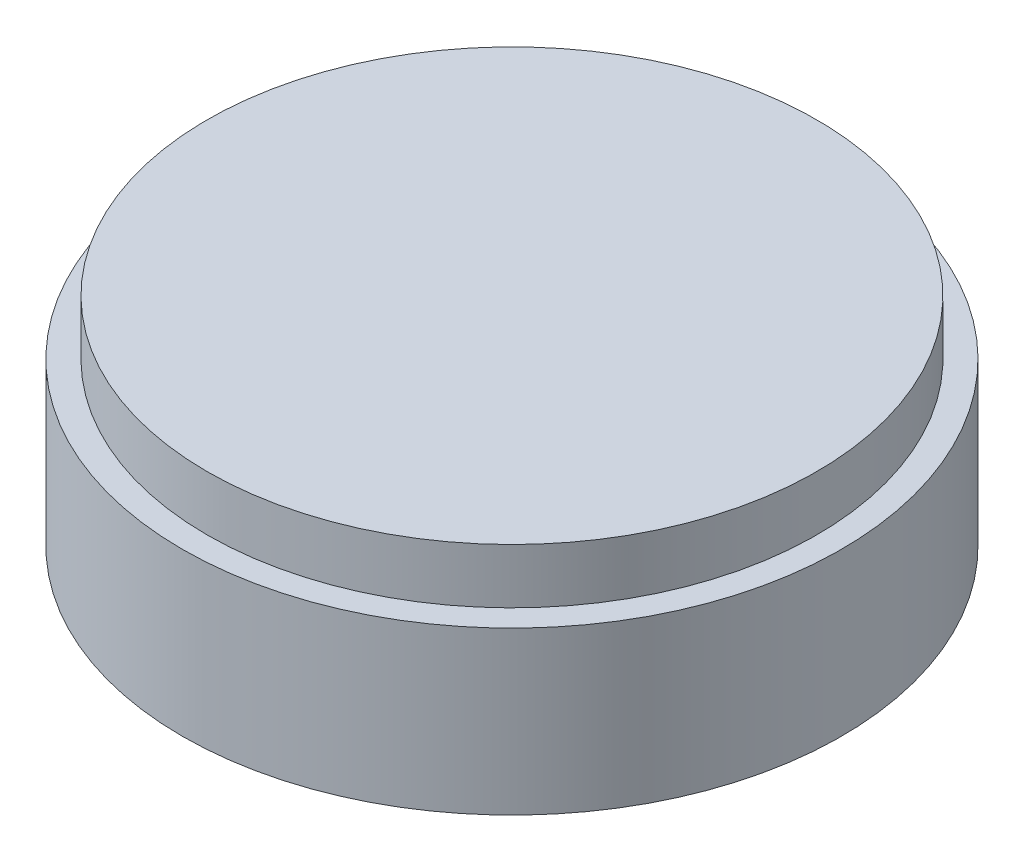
ISO-10303-21;
HEADER;
FILE_DESCRIPTION(('STEP AP214'),'2;1');
FILE_NAME('part.step','',(''),(''),'','','');
FILE_SCHEMA(('AUTOMOTIVE_DESIGN { 1 0 10303 214 1 1 1 1 }'));
ENDSEC;
DATA;
#1=APPLICATION_CONTEXT('core data for automotive mechanical design processes');
#2=APPLICATION_PROTOCOL_DEFINITION('international standard','automotive_design',2000,#1);
#3=PRODUCT_CONTEXT('',#1,'mechanical');
#4=PRODUCT('Part','Part','',(#3));
#5=PRODUCT_RELATED_PRODUCT_CATEGORY('part','',(#4));
#6=PRODUCT_DEFINITION_FORMATION('','',#4);
#7=PRODUCT_DEFINITION_CONTEXT('part definition',#1,'design');
#8=PRODUCT_DEFINITION('design','',#6,#7);
#9=PRODUCT_DEFINITION_SHAPE('','',#8);
#10=(LENGTH_UNIT() NAMED_UNIT(*) SI_UNIT(.MILLI.,.METRE.));
#11=(NAMED_UNIT(*) PLANE_ANGLE_UNIT() SI_UNIT($,.RADIAN.));
#12=(NAMED_UNIT(*) SI_UNIT($,.STERADIAN.) SOLID_ANGLE_UNIT());
#13=UNCERTAINTY_MEASURE_WITH_UNIT(LENGTH_MEASURE(1.E-05),#10,'distance_accuracy_value','');
#14=(GEOMETRIC_REPRESENTATION_CONTEXT(3) GLOBAL_UNCERTAINTY_ASSIGNED_CONTEXT((#13)) GLOBAL_UNIT_ASSIGNED_CONTEXT((#10,
#11,#12)) REPRESENTATION_CONTEXT('',''));
#15=CARTESIAN_POINT('',(0.,0.,0.));
#16=DIRECTION('',(0.,0.,1.));
#17=DIRECTION('',(1.,0.,0.));
#18=AXIS2_PLACEMENT_3D('',#15,#16,#17);
#19=CARTESIAN_POINT('',(0.,18.6,0.));
#20=DIRECTION('',(0.,-1.,0.));
#21=DIRECTION('',(0.,0.,-1.));
#22=AXIS2_PLACEMENT_3D('',#19,#20,#21);
#23=CYLINDRICAL_SURFACE('',#22,37.85);
#24=CARTESIAN_POINT('',(0.,18.6,0.));
#25=DIRECTION('',(0.,1.,0.));
#26=DIRECTION('',(0.,0.,1.));
#27=AXIS2_PLACEMENT_3D('',#24,#25,#26);
#28=CIRCLE('',#27,37.85);
#29=CARTESIAN_POINT('',(0.,18.6,37.85));
#30=VERTEX_POINT('',#29);
#31=EDGE_CURVE('E54',#30,#30,#28,.T.);
#32=ORIENTED_EDGE('',*,*,#31,.F.);
#33=EDGE_LOOP('',(#32));
#34=FACE_BOUND('',#33,.T.);
#35=CARTESIAN_POINT('',(0.,0.,0.));
#36=DIRECTION('',(0.,1.,0.));
#37=DIRECTION('',(0.,0.,1.));
#38=AXIS2_PLACEMENT_3D('',#35,#36,#37);
#39=CIRCLE('',#38,37.85);
#40=CARTESIAN_POINT('',(0.,0.,37.85));
#41=VERTEX_POINT('',#40);
#42=EDGE_CURVE('E50',#41,#41,#39,.T.);
#43=ORIENTED_EDGE('',*,*,#42,.T.);
#44=EDGE_LOOP('',(#43));
#45=FACE_BOUND('',#44,.T.);
#46=ADVANCED_FACE('F47',(#34,#45),#23,.T.);
#47=CARTESIAN_POINT('',(0.,18.6,0.));
#48=DIRECTION('',(0.,1.,0.));
#49=DIRECTION('',(0.,0.,1.));
#50=AXIS2_PLACEMENT_3D('',#47,#48,#49);
#51=PLANE('',#50);
#52=CARTESIAN_POINT('',(0.,18.6,0.));
#53=DIRECTION('',(0.,1.,0.));
#54=DIRECTION('',(0.,0.,1.));
#55=AXIS2_PLACEMENT_3D('',#52,#53,#54);
#56=CIRCLE('',#55,35.);
#57=CARTESIAN_POINT('',(0.,18.6,35.));
#58=VERTEX_POINT('',#57);
#59=EDGE_CURVE('E10',#58,#58,#56,.T.);
#60=ORIENTED_EDGE('',*,*,#59,.F.);
#61=EDGE_LOOP('',(#60));
#62=FACE_BOUND('',#61,.T.);
#63=ORIENTED_EDGE('',*,*,#31,.T.);
#64=EDGE_LOOP('',(#63));
#65=FACE_BOUND('',#64,.T.);
#66=ADVANCED_FACE('F107',(#62,#65),#51,.T.);
#67=CARTESIAN_POINT('',(0.,0.,0.));
#68=DIRECTION('',(0.,1.,0.));
#69=DIRECTION('',(0.,0.,1.));
#70=AXIS2_PLACEMENT_3D('',#67,#68,#69);
#71=PLANE('',#70);
#72=CARTESIAN_POINT('',(0.,0.,29.5));
#73=DIRECTION('',(0.,-1.,0.));
#74=DIRECTION('',(0.,0.,-1.));
#75=AXIS2_PLACEMENT_3D('',#72,#73,#74);
#76=CIRCLE('',#75,1.5);
#77=CARTESIAN_POINT('',(0.,0.,28.));
#78=VERTEX_POINT('',#77);
#79=EDGE_CURVE('E70',#78,#78,#76,.T.);
#80=ORIENTED_EDGE('',*,*,#79,.F.);
#81=EDGE_LOOP('',(#80));
#82=FACE_BOUND('',#81,.T.);
#83=CARTESIAN_POINT('',(-20.8596500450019,0.,-20.8596500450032));
#84=DIRECTION('',(0.,-1.,0.));
#85=DIRECTION('',(0.,0.,-1.));
#86=AXIS2_PLACEMENT_3D('',#83,#84,#85);
#87=CIRCLE('',#86,1.50000000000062);
#88=CARTESIAN_POINT('',(-20.8596500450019,0.,-22.3596500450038));
#89=VERTEX_POINT('',#88);
#90=EDGE_CURVE('E76',#89,#89,#87,.T.);
#91=ORIENTED_EDGE('',*,*,#90,.F.);
#92=EDGE_LOOP('',(#91));
#93=FACE_BOUND('',#92,.T.);
#94=CARTESIAN_POINT('',(20.8596500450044,0.,-20.8596500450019));
#95=DIRECTION('',(0.,-1.,0.));
#96=DIRECTION('',(0.,0.,-1.));
#97=AXIS2_PLACEMENT_3D('',#94,#95,#96);
#98=CIRCLE('',#97,1.50000000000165);
#99=CARTESIAN_POINT('',(20.8596500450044,0.,-22.3596500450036));
#100=VERTEX_POINT('',#99);
#101=EDGE_CURVE('E82',#100,#100,#98,.T.);
#102=ORIENTED_EDGE('',*,*,#101,.F.);
#103=EDGE_LOOP('',(#102));
#104=FACE_BOUND('',#103,.T.);
#105=CARTESIAN_POINT('',(20.8596500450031,0.,20.8596500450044));
#106=DIRECTION('',(0.,-1.,0.));
#107=DIRECTION('',(0.,0.,-1.));
#108=AXIS2_PLACEMENT_3D('',#105,#106,#107);
#109=CIRCLE('',#108,1.50000000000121);
#110=CARTESIAN_POINT('',(20.8596500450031,0.,19.3596500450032));
#111=VERTEX_POINT('',#110);
#112=EDGE_CURVE('E88',#111,#111,#109,.T.);
#113=ORIENTED_EDGE('',*,*,#112,.F.);
#114=EDGE_LOOP('',(#113));
#115=FACE_BOUND('',#114,.T.);
#116=CARTESIAN_POINT('',(-20.8596500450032,0.,20.8596500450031));
#117=DIRECTION('',(0.,-1.,0.));
#118=DIRECTION('',(0.,0.,-1.));
#119=AXIS2_PLACEMENT_3D('',#116,#117,#118);
#120=CIRCLE('',#119,1.5);
#121=CARTESIAN_POINT('',(-20.8596500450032,0.,19.3596500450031));
#122=VERTEX_POINT('',#121);
#123=EDGE_CURVE('E64',#122,#122,#120,.T.);
#124=ORIENTED_EDGE('',*,*,#123,.F.);
#125=EDGE_LOOP('',(#124));
#126=FACE_BOUND('',#125,.T.);
#127=ORIENTED_EDGE('',*,*,#42,.F.);
#128=EDGE_LOOP('',(#127));
#129=FACE_BOUND('',#128,.T.);
#130=ADVANCED_FACE('F103',(#82,#93,#104,#115,#126,#129),#71,.F.);
#131=CARTESIAN_POINT('',(0.,24.9,0.));
#132=DIRECTION('',(0.,-1.,0.));
#133=DIRECTION('',(0.,0.,-1.));
#134=AXIS2_PLACEMENT_3D('',#131,#132,#133);
#135=CYLINDRICAL_SURFACE('',#134,35.);
#136=CARTESIAN_POINT('',(0.,24.9,0.));
#137=DIRECTION('',(0.,1.,0.));
#138=DIRECTION('',(0.,0.,1.));
#139=AXIS2_PLACEMENT_3D('',#136,#137,#138);
#140=CIRCLE('',#139,35.);
#141=CARTESIAN_POINT('',(0.,24.9,35.));
#142=VERTEX_POINT('',#141);
#143=EDGE_CURVE('E60',#142,#142,#140,.T.);
#144=ORIENTED_EDGE('',*,*,#143,.F.);
#145=EDGE_LOOP('',(#144));
#146=FACE_BOUND('',#145,.T.);
#147=ORIENTED_EDGE('',*,*,#59,.T.);
#148=EDGE_LOOP('',(#147));
#149=FACE_BOUND('',#148,.T.);
#150=ADVANCED_FACE('F106',(#146,#149),#135,.T.);
#151=CARTESIAN_POINT('',(0.,24.9,0.));
#152=DIRECTION('',(0.,1.,0.));
#153=DIRECTION('',(0.,0.,1.));
#154=AXIS2_PLACEMENT_3D('',#151,#152,#153);
#155=PLANE('',#154);
#156=ORIENTED_EDGE('',*,*,#143,.T.);
#157=EDGE_LOOP('',(#156));
#158=FACE_BOUND('',#157,.T.);
#159=ADVANCED_FACE('F128',(#158),#155,.T.);
#160=CARTESIAN_POINT('',(-20.8596500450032,6.3,20.8596500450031));
#161=DIRECTION('',(0.,-1.,0.));
#162=DIRECTION('',(0.,0.,-1.));
#163=AXIS2_PLACEMENT_3D('',#160,#161,#162);
#164=CYLINDRICAL_SURFACE('',#163,1.5);
#165=CARTESIAN_POINT('',(-20.8596500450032,6.3,20.8596500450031));
#166=DIRECTION('',(0.,-1.,0.));
#167=DIRECTION('',(0.,0.,-1.));
#168=AXIS2_PLACEMENT_3D('',#165,#166,#167);
#169=CIRCLE('',#168,1.5);
#170=CARTESIAN_POINT('',(-20.8596500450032,6.3,19.3596500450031));
#171=VERTEX_POINT('',#170);
#172=EDGE_CURVE('E63',#171,#171,#169,.T.);
#173=ORIENTED_EDGE('',*,*,#172,.F.);
#174=EDGE_LOOP('',(#173));
#175=FACE_BOUND('',#174,.T.);
#176=ORIENTED_EDGE('',*,*,#123,.T.);
#177=EDGE_LOOP('',(#176));
#178=FACE_BOUND('',#177,.T.);
#179=ADVANCED_FACE('F132',(#175,#178),#164,.F.);
#180=CARTESIAN_POINT('',(-20.8596500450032,6.3,20.8596500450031));
#181=DIRECTION('',(0.,-1.,0.));
#182=DIRECTION('',(0.,0.,-1.));
#183=AXIS2_PLACEMENT_3D('',#180,#181,#182);
#184=PLANE('',#183);
#185=ORIENTED_EDGE('',*,*,#172,.T.);
#186=EDGE_LOOP('',(#185));
#187=FACE_BOUND('',#186,.T.);
#188=ADVANCED_FACE('F99',(#187),#184,.T.);
#189=CARTESIAN_POINT('',(20.8596500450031,6.3,20.8596500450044));
#190=DIRECTION('',(0.,-1.,0.));
#191=DIRECTION('',(0.,0.,-1.));
#192=AXIS2_PLACEMENT_3D('',#189,#190,#191);
#193=CYLINDRICAL_SURFACE('',#192,1.50000000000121);
#194=CARTESIAN_POINT('',(20.8596500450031,6.3,20.8596500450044));
#195=DIRECTION('',(0.,-1.,0.));
#196=DIRECTION('',(0.,0.,-1.));
#197=AXIS2_PLACEMENT_3D('',#194,#195,#196);
#198=CIRCLE('',#197,1.50000000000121);
#199=CARTESIAN_POINT('',(20.8596500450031,6.3,19.3596500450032));
#200=VERTEX_POINT('',#199);
#201=EDGE_CURVE('E67',#200,#200,#198,.T.);
#202=ORIENTED_EDGE('',*,*,#201,.F.);
#203=EDGE_LOOP('',(#202));
#204=FACE_BOUND('',#203,.T.);
#205=ORIENTED_EDGE('',*,*,#112,.T.);
#206=EDGE_LOOP('',(#205));
#207=FACE_BOUND('',#206,.T.);
#208=ADVANCED_FACE('F96',(#204,#207),#193,.F.);
#209=CARTESIAN_POINT('',(20.8596500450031,6.3,20.8596500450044));
#210=DIRECTION('',(0.,-1.,0.));
#211=DIRECTION('',(0.,0.,-1.));
#212=AXIS2_PLACEMENT_3D('',#209,#210,#211);
#213=PLANE('',#212);
#214=ORIENTED_EDGE('',*,*,#201,.T.);
#215=EDGE_LOOP('',(#214));
#216=FACE_BOUND('',#215,.T.);
#217=ADVANCED_FACE('F94',(#216),#213,.T.);
#218=CARTESIAN_POINT('',(20.8596500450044,6.3,-20.8596500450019));
#219=DIRECTION('',(0.,-1.,0.));
#220=DIRECTION('',(0.,0.,-1.));
#221=AXIS2_PLACEMENT_3D('',#218,#219,#220);
#222=CYLINDRICAL_SURFACE('',#221,1.50000000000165);
#223=CARTESIAN_POINT('',(20.8596500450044,6.3,-20.8596500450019));
#224=DIRECTION('',(0.,-1.,0.));
#225=DIRECTION('',(0.,0.,-1.));
#226=AXIS2_PLACEMENT_3D('',#223,#224,#225);
#227=CIRCLE('',#226,1.50000000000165);
#228=CARTESIAN_POINT('',(20.8596500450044,6.3,-22.3596500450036));
#229=VERTEX_POINT('',#228);
#230=EDGE_CURVE('E85',#229,#229,#227,.T.);
#231=ORIENTED_EDGE('',*,*,#230,.F.);
#232=EDGE_LOOP('',(#231));
#233=FACE_BOUND('',#232,.T.);
#234=ORIENTED_EDGE('',*,*,#101,.T.);
#235=EDGE_LOOP('',(#234));
#236=FACE_BOUND('',#235,.T.);
#237=ADVANCED_FACE('F157',(#233,#236),#222,.F.);
#238=CARTESIAN_POINT('',(20.8596500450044,6.3,-20.8596500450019));
#239=DIRECTION('',(0.,-1.,0.));
#240=DIRECTION('',(0.,0.,-1.));
#241=AXIS2_PLACEMENT_3D('',#238,#239,#240);
#242=PLANE('',#241);
#243=ORIENTED_EDGE('',*,*,#230,.T.);
#244=EDGE_LOOP('',(#243));
#245=FACE_BOUND('',#244,.T.);
#246=ADVANCED_FACE('F152',(#245),#242,.T.);
#247=CARTESIAN_POINT('',(-20.8596500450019,6.3,-20.8596500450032));
#248=DIRECTION('',(0.,-1.,0.));
#249=DIRECTION('',(0.,0.,-1.));
#250=AXIS2_PLACEMENT_3D('',#247,#248,#249);
#251=CYLINDRICAL_SURFACE('',#250,1.50000000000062);
#252=CARTESIAN_POINT('',(-20.8596500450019,6.3,-20.8596500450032));
#253=DIRECTION('',(0.,-1.,0.));
#254=DIRECTION('',(0.,0.,-1.));
#255=AXIS2_PLACEMENT_3D('',#252,#253,#254);
#256=CIRCLE('',#255,1.50000000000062);
#257=CARTESIAN_POINT('',(-20.8596500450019,6.3,-22.3596500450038));
#258=VERTEX_POINT('',#257);
#259=EDGE_CURVE('E79',#258,#258,#256,.T.);
#260=ORIENTED_EDGE('',*,*,#259,.F.);
#261=EDGE_LOOP('',(#260));
#262=FACE_BOUND('',#261,.T.);
#263=ORIENTED_EDGE('',*,*,#90,.T.);
#264=EDGE_LOOP('',(#263));
#265=FACE_BOUND('',#264,.T.);
#266=ADVANCED_FACE('F149',(#262,#265),#251,.F.);
#267=CARTESIAN_POINT('',(-20.8596500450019,6.3,-20.8596500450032));
#268=DIRECTION('',(0.,-1.,0.));
#269=DIRECTION('',(0.,0.,-1.));
#270=AXIS2_PLACEMENT_3D('',#267,#268,#269);
#271=PLANE('',#270);
#272=ORIENTED_EDGE('',*,*,#259,.T.);
#273=EDGE_LOOP('',(#272));
#274=FACE_BOUND('',#273,.T.);
#275=ADVANCED_FACE('F144',(#274),#271,.T.);
#276=CARTESIAN_POINT('',(0.,6.3,29.5));
#277=DIRECTION('',(0.,-1.,0.));
#278=DIRECTION('',(0.,0.,-1.));
#279=AXIS2_PLACEMENT_3D('',#276,#277,#278);
#280=CYLINDRICAL_SURFACE('',#279,1.5);
#281=CARTESIAN_POINT('',(0.,6.3,29.5));
#282=DIRECTION('',(0.,-1.,0.));
#283=DIRECTION('',(0.,0.,-1.));
#284=AXIS2_PLACEMENT_3D('',#281,#282,#283);
#285=CIRCLE('',#284,1.5);
#286=CARTESIAN_POINT('',(0.,6.3,28.));
#287=VERTEX_POINT('',#286);
#288=EDGE_CURVE('E73',#287,#287,#285,.T.);
#289=ORIENTED_EDGE('',*,*,#288,.F.);
#290=EDGE_LOOP('',(#289));
#291=FACE_BOUND('',#290,.T.);
#292=ORIENTED_EDGE('',*,*,#79,.T.);
#293=EDGE_LOOP('',(#292));
#294=FACE_BOUND('',#293,.T.);
#295=ADVANCED_FACE('F140',(#291,#294),#280,.F.);
#296=CARTESIAN_POINT('',(0.,6.3,29.5));
#297=DIRECTION('',(0.,-1.,0.));
#298=DIRECTION('',(0.,0.,-1.));
#299=AXIS2_PLACEMENT_3D('',#296,#297,#298);
#300=PLANE('',#299);
#301=ORIENTED_EDGE('',*,*,#288,.T.);
#302=EDGE_LOOP('',(#301));
#303=FACE_BOUND('',#302,.T.);
#304=ADVANCED_FACE('F143',(#303),#300,.T.);
#305=CLOSED_SHELL('',(#46,#66,#130,#150,#159,#179,#188,#208,#217,#237,#246,#266,#275,#295,#304));
#306=MANIFOLD_SOLID_BREP('B2',#305);
#307=ADVANCED_BREP_SHAPE_REPRESENTATION('',(#18,#306),#14);
#308=SHAPE_DEFINITION_REPRESENTATION(#9,#307);
ENDSEC;
END-ISO-10303-21;
